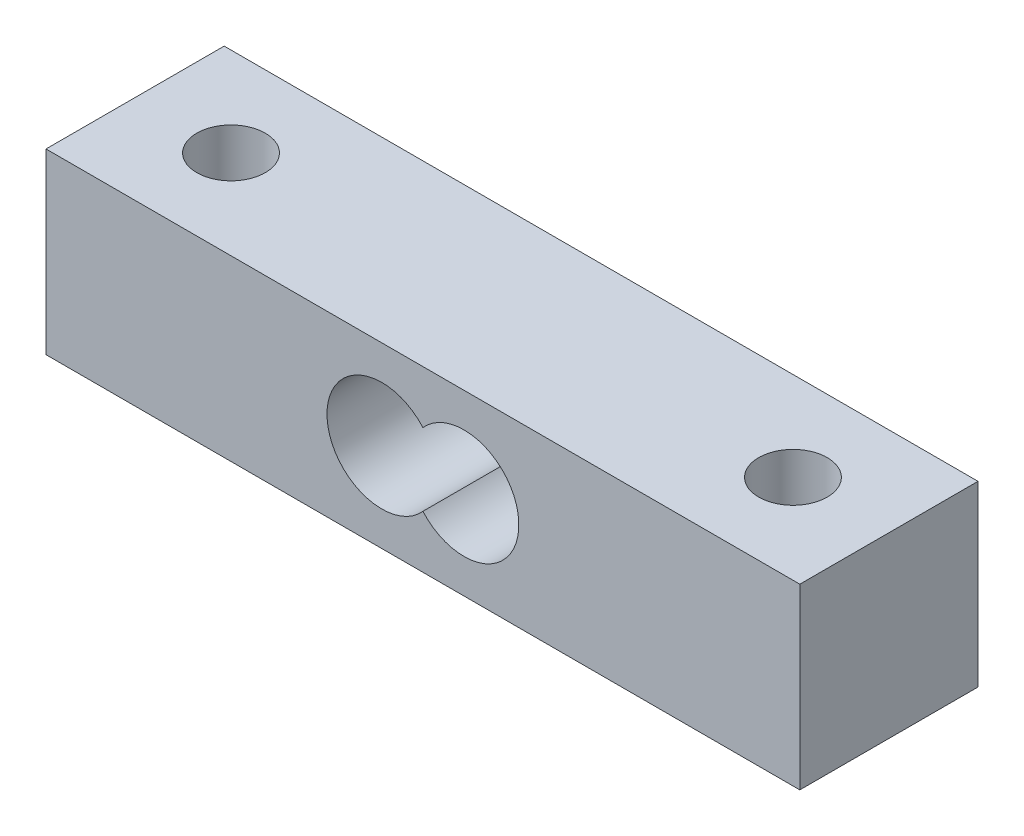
from build123d import *

# Parameters (mm, degrees)
ESQUISSE1_W             = 55
ESQUISSE1_H             = 13
BOSS_EXTRU_1_DEPTH      = 13
ESQUISSE2_R             = 2.5
ENL_V_MAT_EXTRU_1_DEPTH = 13


with BuildPart() as part:
    # Esquisse1 → Boss.-Extru.1 (new body)
    with BuildSketch(Plane.XY):
        Rectangle(ESQUISSE1_W, ESQUISSE1_H)
        with BuildLine():
            ThreePointArc((0, 2.645751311), (-7, 0), (0, -2.645751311))
            ThreePointArc((0, -2.645751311), (7, 0), (0, 2.645751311))
        make_face(mode=Mode.SUBTRACT)
    extrude(amount=BOSS_EXTRU_1_DEPTH)

    # Esquisse2 → Enl_v. mat.-Extru.1 (cut)
    with BuildSketch(Plane(origin=(0, 6.5, 0), x_dir=(1, 0, 0), z_dir=(0, 1, 0))):
        with Locations(Location((-20.5, -6.5, 0), (0, 0, 270))):
            Circle(ESQUISSE2_R)
        with Locations(Location((20.5, -6.5, 0), (0, 0, 270))):
            Circle(ESQUISSE2_R)
    extrude(amount=-ENL_V_MAT_EXTRU_1_DEPTH, mode=Mode.SUBTRACT)


solid = part.part
